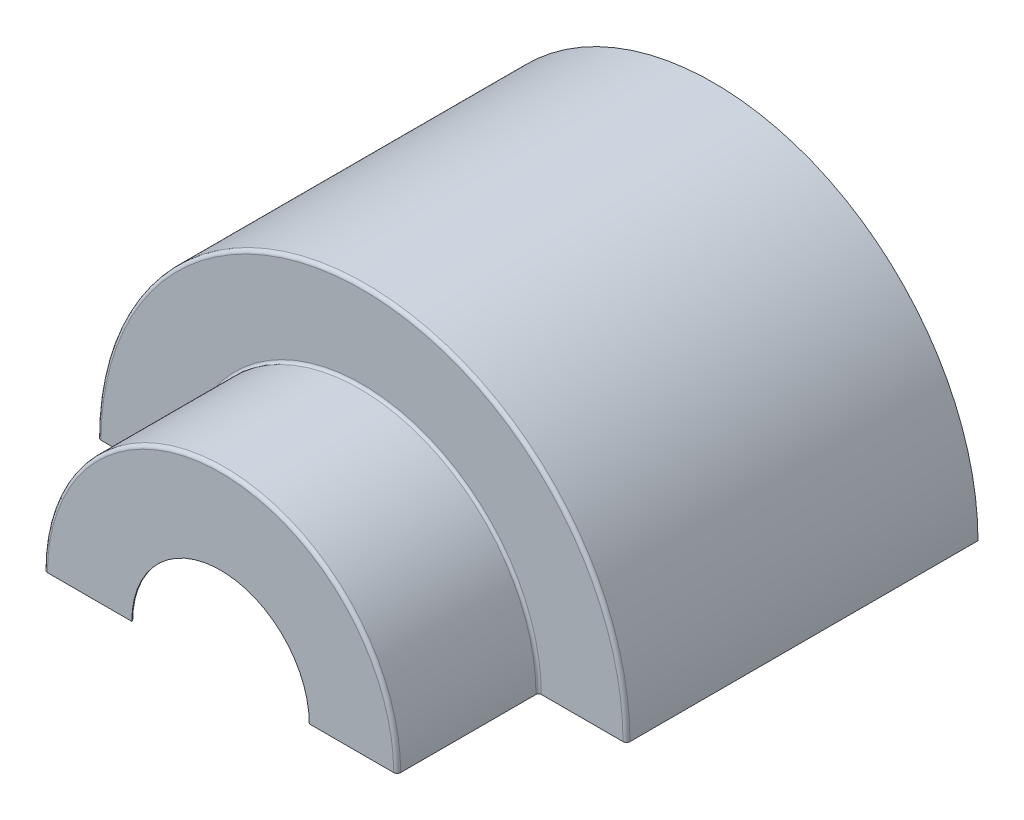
ISO-10303-21;
HEADER;
FILE_DESCRIPTION(('STEP AP214'),'2;1');
FILE_NAME('part.step','',(''),(''),'','','');
FILE_SCHEMA(('AUTOMOTIVE_DESIGN { 1 0 10303 214 1 1 1 1 }'));
ENDSEC;
DATA;
#1=APPLICATION_CONTEXT('core data for automotive mechanical design processes');
#2=APPLICATION_PROTOCOL_DEFINITION('international standard','automotive_design',2000,#1);
#3=PRODUCT_CONTEXT('',#1,'mechanical');
#4=PRODUCT('Part','Part','',(#3));
#5=PRODUCT_RELATED_PRODUCT_CATEGORY('part','',(#4));
#6=PRODUCT_DEFINITION_FORMATION('','',#4);
#7=PRODUCT_DEFINITION_CONTEXT('part definition',#1,'design');
#8=PRODUCT_DEFINITION('design','',#6,#7);
#9=PRODUCT_DEFINITION_SHAPE('','',#8);
#10=(LENGTH_UNIT() NAMED_UNIT(*) SI_UNIT(.MILLI.,.METRE.));
#11=(NAMED_UNIT(*) PLANE_ANGLE_UNIT() SI_UNIT($,.RADIAN.));
#12=(NAMED_UNIT(*) SI_UNIT($,.STERADIAN.) SOLID_ANGLE_UNIT());
#13=UNCERTAINTY_MEASURE_WITH_UNIT(LENGTH_MEASURE(1.E-05),#10,'distance_accuracy_value','');
#14=(GEOMETRIC_REPRESENTATION_CONTEXT(3) GLOBAL_UNCERTAINTY_ASSIGNED_CONTEXT((#13)) GLOBAL_UNIT_ASSIGNED_CONTEXT((#10,
#11,#12)) REPRESENTATION_CONTEXT('',''));
#15=CARTESIAN_POINT('',(0.,0.,0.));
#16=DIRECTION('',(0.,0.,1.));
#17=DIRECTION('',(1.,0.,0.));
#18=AXIS2_PLACEMENT_3D('',#15,#16,#17);
#19=CARTESIAN_POINT('',(100.5,0.,-80.));
#20=DIRECTION('',(0.,-1.,0.));
#21=DIRECTION('',(1.,0.,0.));
#22=AXIS2_PLACEMENT_3D('',#19,#20,#21);
#23=PLANE('',#22);
#24=DIRECTION('',(0.,0.,1.));
#25=VECTOR('',#24,1.);
#26=CARTESIAN_POINT('',(148.5,0.,-80.5));
#27=LINE('',#26,#25);
#28=CARTESIAN_POINT('',(148.5,0.,-80.5));
#29=VERTEX_POINT('',#28);
#30=CARTESIAN_POINT('',(148.5,0.,-80.));
#31=VERTEX_POINT('',#30);
#32=EDGE_CURVE('E329',#29,#31,#27,.T.);
#33=ORIENTED_EDGE('',*,*,#32,.T.);
#34=DIRECTION('',(1.,0.,0.));
#35=VECTOR('',#34,1.);
#36=CARTESIAN_POINT('',(100.5,0.,-80.));
#37=LINE('',#36,#35);
#38=CARTESIAN_POINT('',(102.,0.,-80.));
#39=VERTEX_POINT('',#38);
#40=EDGE_CURVE('E340',#39,#31,#37,.T.);
#41=ORIENTED_EDGE('',*,*,#40,.F.);
#42=DIRECTION('',(0.,0.,1.));
#43=VECTOR('',#42,1.);
#44=CARTESIAN_POINT('',(102.,0.,-80.));
#45=LINE('',#44,#43);
#46=CARTESIAN_POINT('',(102.,0.,-80.5));
#47=VERTEX_POINT('',#46);
#48=EDGE_CURVE('E355',#47,#39,#45,.T.);
#49=ORIENTED_EDGE('',*,*,#48,.F.);
#50=DIRECTION('',(1.,0.,0.));
#51=VECTOR('',#50,1.);
#52=CARTESIAN_POINT('',(100.5,0.,-80.5));
#53=LINE('',#52,#51);
#54=EDGE_CURVE('E360',#47,#29,#53,.T.);
#55=ORIENTED_EDGE('',*,*,#54,.T.);
#56=EDGE_LOOP('',(#33,#41,#49,#55));
#57=FACE_BOUND('',#56,.T.);
#58=ADVANCED_FACE('F159',(#57),#23,.T.);
#59=CARTESIAN_POINT('',(100.5,0.,-80.));
#60=DIRECTION('',(0.,0.,1.));
#61=DIRECTION('',(1.,0.,0.));
#62=AXIS2_PLACEMENT_3D('',#59,#60,#61);
#63=PLANE('',#62);
#64=ORIENTED_EDGE('',*,*,#40,.T.);
#65=CARTESIAN_POINT('',(0.,0.,-80.));
#66=DIRECTION('',(0.,0.,1.));
#67=DIRECTION('',(1.,0.,0.));
#68=AXIS2_PLACEMENT_3D('',#65,#66,#67);
#69=CIRCLE('',#68,148.5);
#70=CARTESIAN_POINT('',(-148.5,0.,-80.));
#71=VERTEX_POINT('',#70);
#72=EDGE_CURVE('E295',#31,#71,#69,.T.);
#73=ORIENTED_EDGE('',*,*,#72,.T.);
#74=DIRECTION('',(-1.,0.,0.));
#75=VECTOR('',#74,1.);
#76=CARTESIAN_POINT('',(-100.5,0.,-80.));
#77=LINE('',#76,#75);
#78=CARTESIAN_POINT('',(-102.,0.,-80.));
#79=VERTEX_POINT('',#78);
#80=EDGE_CURVE('E349',#79,#71,#77,.T.);
#81=ORIENTED_EDGE('',*,*,#80,.F.);
#82=CARTESIAN_POINT('',(0.,0.,-80.));
#83=DIRECTION('',(0.,0.,1.));
#84=DIRECTION('',(1.,0.,0.));
#85=AXIS2_PLACEMENT_3D('',#82,#83,#84);
#86=CIRCLE('',#85,102.);
#87=EDGE_CURVE('E345',#39,#79,#86,.T.);
#88=ORIENTED_EDGE('',*,*,#87,.F.);
#89=EDGE_LOOP('',(#64,#73,#81,#88));
#90=FACE_BOUND('',#89,.T.);
#91=ADVANCED_FACE('F501',(#90),#63,.T.);
#92=CARTESIAN_POINT('',(100.5,0.,-80.5));
#93=DIRECTION('',(0.,0.,1.));
#94=DIRECTION('',(1.,0.,0.));
#95=AXIS2_PLACEMENT_3D('',#92,#93,#94);
#96=PLANE('',#95);
#97=CARTESIAN_POINT('',(0.,0.,-80.5));
#98=DIRECTION('',(0.,0.,1.));
#99=DIRECTION('',(1.,0.,0.));
#100=AXIS2_PLACEMENT_3D('',#97,#98,#99);
#101=CIRCLE('',#100,148.5);
#102=CARTESIAN_POINT('',(-148.5,0.,-80.5));
#103=VERTEX_POINT('',#102);
#104=EDGE_CURVE('E319',#29,#103,#101,.T.);
#105=ORIENTED_EDGE('',*,*,#104,.F.);
#106=ORIENTED_EDGE('',*,*,#54,.F.);
#107=CARTESIAN_POINT('',(0.,0.,-80.5));
#108=DIRECTION('',(0.,0.,1.));
#109=DIRECTION('',(1.,0.,0.));
#110=AXIS2_PLACEMENT_3D('',#107,#108,#109);
#111=CIRCLE('',#110,102.);
#112=CARTESIAN_POINT('',(-102.,0.,-80.5));
#113=VERTEX_POINT('',#112);
#114=EDGE_CURVE('E356',#47,#113,#111,.T.);
#115=ORIENTED_EDGE('',*,*,#114,.T.);
#116=DIRECTION('',(1.,0.,0.));
#117=VECTOR('',#116,1.);
#118=CARTESIAN_POINT('',(100.5,0.,-80.5));
#119=LINE('',#118,#117);
#120=EDGE_CURVE('E341',#113,#103,#119,.F.);
#121=ORIENTED_EDGE('',*,*,#120,.T.);
#122=EDGE_LOOP('',(#105,#106,#115,#121));
#123=FACE_BOUND('',#122,.T.);
#124=ADVANCED_FACE('F488',(#123),#96,.F.);
#125=CARTESIAN_POINT('',(100.5,0.,-80.));
#126=DIRECTION('',(0.,1.,0.));
#127=DIRECTION('',(-1.,0.,0.));
#128=AXIS2_PLACEMENT_3D('',#125,#126,#127);
#129=PLANE('',#128);
#130=DIRECTION('',(1.,0.,0.));
#131=VECTOR('',#130,1.);
#132=CARTESIAN_POINT('',(100.5,0.,-78.5));
#133=LINE('',#132,#131);
#134=CARTESIAN_POINT('',(100.,0.,-78.5));
#135=VERTEX_POINT('',#134);
#136=CARTESIAN_POINT('',(100.5,0.,-78.5));
#137=VERTEX_POINT('',#136);
#138=EDGE_CURVE('E372',#135,#137,#133,.T.);
#139=ORIENTED_EDGE('',*,*,#138,.T.);
#140=DIRECTION('',(0.,0.,1.));
#141=VECTOR('',#140,1.);
#142=CARTESIAN_POINT('',(100.5,0.,-80.));
#143=LINE('',#142,#141);
#144=CARTESIAN_POINT('',(100.5,0.,-1.49999999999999));
#145=VERTEX_POINT('',#144);
#146=EDGE_CURVE('E12',#137,#145,#143,.T.);
#147=ORIENTED_EDGE('',*,*,#146,.T.);
#148=DIRECTION('',(-1.,0.,0.));
#149=VECTOR('',#148,1.);
#150=CARTESIAN_POINT('',(100.,0.,-1.5));
#151=LINE('',#150,#149);
#152=CARTESIAN_POINT('',(100.,0.,-1.5));
#153=VERTEX_POINT('',#152);
#154=EDGE_CURVE('E427',#145,#153,#151,.T.);
#155=ORIENTED_EDGE('',*,*,#154,.T.);
#156=DIRECTION('',(0.,0.,1.));
#157=VECTOR('',#156,1.);
#158=CARTESIAN_POINT('',(100.,0.,-80.));
#159=LINE('',#158,#157);
#160=EDGE_CURVE('E168',#135,#153,#159,.T.);
#161=ORIENTED_EDGE('',*,*,#160,.F.);
#162=EDGE_LOOP('',(#139,#147,#155,#161));
#163=FACE_BOUND('',#162,.T.);
#164=ADVANCED_FACE('F475',(#163),#129,.F.);
#165=CARTESIAN_POINT('',(0.,0.,-80.));
#166=DIRECTION('',(0.,0.,1.));
#167=DIRECTION('',(1.,0.,0.));
#168=AXIS2_PLACEMENT_3D('',#165,#166,#167);
#169=CYLINDRICAL_SURFACE('',#168,100.5);
#170=ORIENTED_EDGE('',*,*,#146,.F.);
#171=CARTESIAN_POINT('',(0.,0.,-78.5));
#172=DIRECTION('',(0.,0.,1.));
#173=DIRECTION('',(1.,0.,0.));
#174=AXIS2_PLACEMENT_3D('',#171,#172,#173);
#175=CIRCLE('',#174,100.5);
#176=CARTESIAN_POINT('',(-100.5,0.,-78.5));
#177=VERTEX_POINT('',#176);
#178=EDGE_CURVE('E346',#137,#177,#175,.T.);
#179=ORIENTED_EDGE('',*,*,#178,.T.);
#180=DIRECTION('',(0.,0.,1.));
#181=VECTOR('',#180,1.);
#182=CARTESIAN_POINT('',(-100.5,0.,-80.));
#183=LINE('',#182,#181);
#184=CARTESIAN_POINT('',(-100.5,0.,-1.49999999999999));
#185=VERTEX_POINT('',#184);
#186=EDGE_CURVE('E163',#177,#185,#183,.T.);
#187=ORIENTED_EDGE('',*,*,#186,.T.);
#188=CARTESIAN_POINT('',(0.,0.,-1.5));
#189=DIRECTION('',(0.,0.,1.));
#190=DIRECTION('',(1.,0.,0.));
#191=AXIS2_PLACEMENT_3D('',#188,#189,#190);
#192=CIRCLE('',#191,100.5);
#193=EDGE_CURVE('E414',#145,#185,#192,.T.);
#194=ORIENTED_EDGE('',*,*,#193,.F.);
#195=EDGE_LOOP('',(#170,#179,#187,#194));
#196=FACE_BOUND('',#195,.T.);
#197=ADVANCED_FACE('F161',(#196),#169,.T.);
#198=CARTESIAN_POINT('',(0.,0.,-80.));
#199=DIRECTION('',(0.,0.,1.));
#200=DIRECTION('',(1.,0.,0.));
#201=AXIS2_PLACEMENT_3D('',#198,#199,#200);
#202=CYLINDRICAL_SURFACE('',#201,100.);
#203=CARTESIAN_POINT('',(0.,0.,-78.5));
#204=DIRECTION('',(0.,0.,1.));
#205=DIRECTION('',(1.,0.,0.));
#206=AXIS2_PLACEMENT_3D('',#203,#204,#205);
#207=CIRCLE('',#206,100.);
#208=CARTESIAN_POINT('',(-100.,0.,-78.5));
#209=VERTEX_POINT('',#208);
#210=EDGE_CURVE('E363',#135,#209,#207,.T.);
#211=ORIENTED_EDGE('',*,*,#210,.F.);
#212=ORIENTED_EDGE('',*,*,#160,.T.);
#213=CARTESIAN_POINT('',(0.,0.,-1.5));
#214=DIRECTION('',(0.,0.,1.));
#215=DIRECTION('',(1.,0.,0.));
#216=AXIS2_PLACEMENT_3D('',#213,#214,#215);
#217=CIRCLE('',#216,100.);
#218=CARTESIAN_POINT('',(-100.,0.,-1.49999999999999));
#219=VERTEX_POINT('',#218);
#220=EDGE_CURVE('E390',#153,#219,#217,.T.);
#221=ORIENTED_EDGE('',*,*,#220,.T.);
#222=DIRECTION('',(0.,0.,1.));
#223=VECTOR('',#222,1.);
#224=CARTESIAN_POINT('',(-100.,0.,-80.));
#225=LINE('',#224,#223);
#226=EDGE_CURVE('E436',#209,#219,#225,.T.);
#227=ORIENTED_EDGE('',*,*,#226,.F.);
#228=EDGE_LOOP('',(#211,#212,#221,#227));
#229=FACE_BOUND('',#228,.T.);
#230=ADVANCED_FACE('F444',(#229),#202,.F.);
#231=CARTESIAN_POINT('',(-100.,0.,-80.));
#232=DIRECTION('',(0.,1.,0.));
#233=DIRECTION('',(-1.,0.,0.));
#234=AXIS2_PLACEMENT_3D('',#231,#232,#233);
#235=PLANE('',#234);
#236=ORIENTED_EDGE('',*,*,#186,.F.);
#237=DIRECTION('',(-1.,0.,0.));
#238=VECTOR('',#237,1.);
#239=CARTESIAN_POINT('',(-100.5,0.,-78.5));
#240=LINE('',#239,#238);
#241=EDGE_CURVE('E375',#209,#177,#240,.T.);
#242=ORIENTED_EDGE('',*,*,#241,.F.);
#243=ORIENTED_EDGE('',*,*,#226,.T.);
#244=DIRECTION('',(1.,0.,0.));
#245=VECTOR('',#244,1.);
#246=CARTESIAN_POINT('',(-100.,0.,-1.5));
#247=LINE('',#246,#245);
#248=EDGE_CURVE('E430',#185,#219,#247,.T.);
#249=ORIENTED_EDGE('',*,*,#248,.F.);
#250=EDGE_LOOP('',(#236,#242,#243,#249));
#251=FACE_BOUND('',#250,.T.);
#252=ADVANCED_FACE('F440',(#251),#235,.F.);
#253=CARTESIAN_POINT('',(-98.5,0.,-1.5));
#254=DIRECTION('',(0.,1.,0.));
#255=DIRECTION('',(-1.,0.,0.));
#256=AXIS2_PLACEMENT_3D('',#253,#254,#255);
#257=PLANE('',#256);
#258=DIRECTION('',(0.,0.,-1.));
#259=VECTOR('',#258,1.);
#260=CARTESIAN_POINT('',(-98.5,0.,0.));
#261=LINE('',#260,#259);
#262=CARTESIAN_POINT('',(-98.5,0.,0.5));
#263=VERTEX_POINT('',#262);
#264=CARTESIAN_POINT('',(-98.5,0.,0.));
#265=VERTEX_POINT('',#264);
#266=EDGE_CURVE('E433',#263,#265,#261,.T.);
#267=ORIENTED_EDGE('',*,*,#266,.F.);
#268=CARTESIAN_POINT('',(-98.5,0.,-1.5));
#269=DIRECTION('',(0.,1.,0.));
#270=DIRECTION('',(-1.,0.,0.));
#271=AXIS2_PLACEMENT_3D('',#268,#269,#270);
#272=CIRCLE('',#271,2.);
#273=EDGE_CURVE('E408',#185,#263,#272,.T.);
#274=ORIENTED_EDGE('',*,*,#273,.F.);
#275=ORIENTED_EDGE('',*,*,#248,.T.);
#276=CARTESIAN_POINT('',(-98.5,0.,-1.5));
#277=DIRECTION('',(0.,-1.,0.));
#278=DIRECTION('',(1.,0.,0.));
#279=AXIS2_PLACEMENT_3D('',#276,#277,#278);
#280=CIRCLE('',#279,1.5);
#281=EDGE_CURVE('E386',#219,#265,#280,.F.);
#282=ORIENTED_EDGE('',*,*,#281,.T.);
#283=EDGE_LOOP('',(#267,#274,#275,#282));
#284=FACE_BOUND('',#283,.T.);
#285=ADVANCED_FACE('F451',(#284),#257,.F.);
#286=CARTESIAN_POINT('',(98.5,0.,-1.5));
#287=DIRECTION('',(0.,-1.,0.));
#288=DIRECTION('',(1.,0.,0.));
#289=AXIS2_PLACEMENT_3D('',#286,#287,#288);
#290=PLANE('',#289);
#291=ORIENTED_EDGE('',*,*,#154,.F.);
#292=CARTESIAN_POINT('',(98.5,0.,-1.5));
#293=DIRECTION('',(0.,-1.,0.));
#294=DIRECTION('',(1.,0.,0.));
#295=AXIS2_PLACEMENT_3D('',#292,#293,#294);
#296=CIRCLE('',#295,2.);
#297=CARTESIAN_POINT('',(98.5,0.,0.499999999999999));
#298=VERTEX_POINT('',#297);
#299=EDGE_CURVE('E380',#145,#298,#296,.T.);
#300=ORIENTED_EDGE('',*,*,#299,.T.);
#301=DIRECTION('',(0.,0.,-1.));
#302=VECTOR('',#301,1.);
#303=CARTESIAN_POINT('',(98.5,0.,0.));
#304=LINE('',#303,#302);
#305=CARTESIAN_POINT('',(98.5,0.,0.));
#306=VERTEX_POINT('',#305);
#307=EDGE_CURVE('E425',#298,#306,#304,.T.);
#308=ORIENTED_EDGE('',*,*,#307,.T.);
#309=CARTESIAN_POINT('',(98.5,0.,-1.5));
#310=DIRECTION('',(0.,1.,0.));
#311=DIRECTION('',(-1.,0.,0.));
#312=AXIS2_PLACEMENT_3D('',#309,#310,#311);
#313=CIRCLE('',#312,1.5);
#314=EDGE_CURVE('E381',#153,#306,#313,.F.);
#315=ORIENTED_EDGE('',*,*,#314,.F.);
#316=EDGE_LOOP('',(#291,#300,#308,#315));
#317=FACE_BOUND('',#316,.T.);
#318=ADVANCED_FACE('F473',(#317),#290,.T.);
#319=CARTESIAN_POINT('',(100.,0.,0.));
#320=DIRECTION('',(0.,-1.,0.));
#321=DIRECTION('',(-1.,0.,0.));
#322=AXIS2_PLACEMENT_3D('',#319,#320,#321);
#323=PLANE('',#322);
#324=ORIENTED_EDGE('',*,*,#307,.F.);
#325=DIRECTION('',(-1.,0.,0.));
#326=VECTOR('',#325,1.);
#327=CARTESIAN_POINT('',(100.,0.,0.5));
#328=LINE('',#327,#326);
#329=CARTESIAN_POINT('',(50.5,0.,0.5));
#330=VERTEX_POINT('',#329);
#331=EDGE_CURVE('E411',#298,#330,#328,.T.);
#332=ORIENTED_EDGE('',*,*,#331,.T.);
#333=DIRECTION('',(0.,0.,-1.));
#334=VECTOR('',#333,1.);
#335=CARTESIAN_POINT('',(50.5,0.,0.));
#336=LINE('',#335,#334);
#337=CARTESIAN_POINT('',(50.5,0.,0.));
#338=VERTEX_POINT('',#337);
#339=EDGE_CURVE('E423',#330,#338,#336,.T.);
#340=ORIENTED_EDGE('',*,*,#339,.T.);
#341=DIRECTION('',(-1.,0.,0.));
#342=VECTOR('',#341,1.);
#343=CARTESIAN_POINT('',(100.,0.,0.));
#344=LINE('',#343,#342);
#345=EDGE_CURVE('E384',#306,#338,#344,.T.);
#346=ORIENTED_EDGE('',*,*,#345,.F.);
#347=EDGE_LOOP('',(#324,#332,#340,#346));
#348=FACE_BOUND('',#347,.T.);
#349=ADVANCED_FACE('F552',(#348),#323,.T.);
#350=CARTESIAN_POINT('',(0.,0.,0.));
#351=DIRECTION('',(0.,0.,-1.));
#352=DIRECTION('',(-1.,0.,0.));
#353=AXIS2_PLACEMENT_3D('',#350,#351,#352);
#354=CYLINDRICAL_SURFACE('',#353,50.5);
#355=ORIENTED_EDGE('',*,*,#339,.F.);
#356=CARTESIAN_POINT('',(0.,0.,0.5));
#357=DIRECTION('',(0.,0.,1.));
#358=DIRECTION('',(1.,0.,0.));
#359=AXIS2_PLACEMENT_3D('',#356,#357,#358);
#360=CIRCLE('',#359,50.5);
#361=CARTESIAN_POINT('',(-50.5,0.,0.5));
#362=VERTEX_POINT('',#361);
#363=EDGE_CURVE('E385',#330,#362,#360,.T.);
#364=ORIENTED_EDGE('',*,*,#363,.T.);
#365=DIRECTION('',(0.,0.,-1.));
#366=VECTOR('',#365,1.);
#367=CARTESIAN_POINT('',(-50.5,0.,0.));
#368=LINE('',#367,#366);
#369=CARTESIAN_POINT('',(-50.5,0.,0.));
#370=VERTEX_POINT('',#369);
#371=EDGE_CURVE('E403',#362,#370,#368,.T.);
#372=ORIENTED_EDGE('',*,*,#371,.T.);
#373=CARTESIAN_POINT('',(0.,0.,0.));
#374=DIRECTION('',(0.,0.,1.));
#375=DIRECTION('',(1.,0.,0.));
#376=AXIS2_PLACEMENT_3D('',#373,#374,#375);
#377=CIRCLE('',#376,50.5);
#378=EDGE_CURVE('E400',#338,#370,#377,.T.);
#379=ORIENTED_EDGE('',*,*,#378,.F.);
#380=EDGE_LOOP('',(#355,#364,#372,#379));
#381=FACE_BOUND('',#380,.T.);
#382=ADVANCED_FACE('F549',(#381),#354,.F.);
#383=CARTESIAN_POINT('',(-100.,0.,0.));
#384=DIRECTION('',(0.,1.,0.));
#385=DIRECTION('',(1.,0.,0.));
#386=AXIS2_PLACEMENT_3D('',#383,#384,#385);
#387=PLANE('',#386);
#388=DIRECTION('',(-1.,0.,0.));
#389=VECTOR('',#388,1.);
#390=CARTESIAN_POINT('',(100.,0.,0.5));
#391=LINE('',#390,#389);
#392=EDGE_CURVE('E407',#263,#362,#391,.F.);
#393=ORIENTED_EDGE('',*,*,#392,.F.);
#394=ORIENTED_EDGE('',*,*,#266,.T.);
#395=DIRECTION('',(1.,0.,0.));
#396=VECTOR('',#395,1.);
#397=CARTESIAN_POINT('',(-100.,0.,0.));
#398=LINE('',#397,#396);
#399=EDGE_CURVE('E393',#265,#370,#398,.T.);
#400=ORIENTED_EDGE('',*,*,#399,.T.);
#401=ORIENTED_EDGE('',*,*,#371,.F.);
#402=EDGE_LOOP('',(#393,#394,#400,#401));
#403=FACE_BOUND('',#402,.T.);
#404=ADVANCED_FACE('F461',(#403),#387,.F.);
#405=CARTESIAN_POINT('',(100.,0.,0.));
#406=DIRECTION('',(0.,0.,-1.));
#407=DIRECTION('',(-1.,0.,0.));
#408=AXIS2_PLACEMENT_3D('',#405,#406,#407);
#409=PLANE('',#408);
#410=ORIENTED_EDGE('',*,*,#378,.T.);
#411=ORIENTED_EDGE('',*,*,#399,.F.);
#412=CARTESIAN_POINT('',(0.,0.,0.));
#413=DIRECTION('',(0.,0.,1.));
#414=DIRECTION('',(1.,0.,0.));
#415=AXIS2_PLACEMENT_3D('',#412,#413,#414);
#416=CIRCLE('',#415,98.5);
#417=EDGE_CURVE('E389',#306,#265,#416,.T.);
#418=ORIENTED_EDGE('',*,*,#417,.F.);
#419=ORIENTED_EDGE('',*,*,#345,.T.);
#420=EDGE_LOOP('',(#410,#411,#418,#419));
#421=FACE_BOUND('',#420,.T.);
#422=ADVANCED_FACE('F457',(#421),#409,.T.);
#423=CARTESIAN_POINT('',(0.,0.,-1.5));
#424=DIRECTION('',(0.,0.,1.));
#425=DIRECTION('',(1.,0.,0.));
#426=AXIS2_PLACEMENT_3D('',#423,#424,#425);
#427=TOROIDAL_SURFACE('',#426,98.5,1.5);
#428=ORIENTED_EDGE('',*,*,#417,.T.);
#429=ORIENTED_EDGE('',*,*,#281,.F.);
#430=ORIENTED_EDGE('',*,*,#220,.F.);
#431=ORIENTED_EDGE('',*,*,#314,.T.);
#432=EDGE_LOOP('',(#428,#429,#430,#431));
#433=FACE_BOUND('',#432,.T.);
#434=ADVANCED_FACE('F452',(#433),#427,.F.);
#435=CARTESIAN_POINT('',(100.,0.,0.5));
#436=DIRECTION('',(0.,0.,-1.));
#437=DIRECTION('',(-1.,0.,0.));
#438=AXIS2_PLACEMENT_3D('',#435,#436,#437);
#439=PLANE('',#438);
#440=ORIENTED_EDGE('',*,*,#363,.F.);
#441=ORIENTED_EDGE('',*,*,#331,.F.);
#442=CARTESIAN_POINT('',(0.,0.,0.499999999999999));
#443=DIRECTION('',(0.,0.,1.));
#444=DIRECTION('',(1.,0.,0.));
#445=AXIS2_PLACEMENT_3D('',#442,#443,#444);
#446=CIRCLE('',#445,98.5);
#447=EDGE_CURVE('E404',#298,#263,#446,.T.);
#448=ORIENTED_EDGE('',*,*,#447,.T.);
#449=ORIENTED_EDGE('',*,*,#392,.T.);
#450=EDGE_LOOP('',(#440,#441,#448,#449));
#451=FACE_BOUND('',#450,.T.);
#452=ADVANCED_FACE('F466',(#451),#439,.F.);
#453=CARTESIAN_POINT('',(0.,0.,-1.5));
#454=DIRECTION('',(0.,0.,1.));
#455=DIRECTION('',(1.,0.,0.));
#456=AXIS2_PLACEMENT_3D('',#453,#454,#455);
#457=TOROIDAL_SURFACE('',#456,98.5,2.);
#458=ORIENTED_EDGE('',*,*,#447,.F.);
#459=ORIENTED_EDGE('',*,*,#299,.F.);
#460=ORIENTED_EDGE('',*,*,#193,.T.);
#461=ORIENTED_EDGE('',*,*,#273,.T.);
#462=EDGE_LOOP('',(#458,#459,#460,#461));
#463=FACE_BOUND('',#462,.T.);
#464=ADVANCED_FACE('F469',(#463),#457,.T.);
#465=CARTESIAN_POINT('',(-102.,0.,-78.5));
#466=DIRECTION('',(0.,1.,0.));
#467=DIRECTION('',(-1.,0.,0.));
#468=AXIS2_PLACEMENT_3D('',#465,#466,#467);
#469=PLANE('',#468);
#470=DIRECTION('',(0.,0.,1.));
#471=VECTOR('',#470,1.);
#472=CARTESIAN_POINT('',(-102.,0.,-80.));
#473=LINE('',#472,#471);
#474=EDGE_CURVE('E378',#113,#79,#473,.T.);
#475=ORIENTED_EDGE('',*,*,#474,.F.);
#476=CARTESIAN_POINT('',(-102.,0.,-78.5));
#477=DIRECTION('',(0.,1.,0.));
#478=DIRECTION('',(-1.,0.,0.));
#479=AXIS2_PLACEMENT_3D('',#476,#477,#478);
#480=CIRCLE('',#479,2.);
#481=EDGE_CURVE('E359',#209,#113,#480,.T.);
#482=ORIENTED_EDGE('',*,*,#481,.F.);
#483=ORIENTED_EDGE('',*,*,#241,.T.);
#484=CARTESIAN_POINT('',(-102.,0.,-78.5));
#485=DIRECTION('',(0.,-1.,0.));
#486=DIRECTION('',(1.,0.,0.));
#487=AXIS2_PLACEMENT_3D('',#484,#485,#486);
#488=CIRCLE('',#487,1.5);
#489=EDGE_CURVE('E342',#177,#79,#488,.F.);
#490=ORIENTED_EDGE('',*,*,#489,.T.);
#491=EDGE_LOOP('',(#475,#482,#483,#490));
#492=FACE_BOUND('',#491,.T.);
#493=ADVANCED_FACE('F495',(#492),#469,.F.);
#494=CARTESIAN_POINT('',(102.,0.,-78.5));
#495=DIRECTION('',(0.,-1.,0.));
#496=DIRECTION('',(1.,0.,0.));
#497=AXIS2_PLACEMENT_3D('',#494,#495,#496);
#498=PLANE('',#497);
#499=ORIENTED_EDGE('',*,*,#138,.F.);
#500=CARTESIAN_POINT('',(102.,0.,-78.5));
#501=DIRECTION('',(0.,-1.,0.));
#502=DIRECTION('',(1.,0.,0.));
#503=AXIS2_PLACEMENT_3D('',#500,#501,#502);
#504=CIRCLE('',#503,2.);
#505=EDGE_CURVE('E335',#135,#47,#504,.T.);
#506=ORIENTED_EDGE('',*,*,#505,.T.);
#507=ORIENTED_EDGE('',*,*,#48,.T.);
#508=CARTESIAN_POINT('',(102.,0.,-78.5));
#509=DIRECTION('',(0.,1.,0.));
#510=DIRECTION('',(-1.,0.,0.));
#511=AXIS2_PLACEMENT_3D('',#508,#509,#510);
#512=CIRCLE('',#511,1.5);
#513=EDGE_CURVE('E337',#137,#39,#512,.F.);
#514=ORIENTED_EDGE('',*,*,#513,.F.);
#515=EDGE_LOOP('',(#499,#506,#507,#514));
#516=FACE_BOUND('',#515,.T.);
#517=ADVANCED_FACE('F479',(#516),#498,.T.);
#518=CARTESIAN_POINT('',(-100.5,0.,-80.));
#519=DIRECTION('',(0.,1.,0.));
#520=DIRECTION('',(-1.,0.,0.));
#521=AXIS2_PLACEMENT_3D('',#518,#519,#520);
#522=PLANE('',#521);
#523=ORIENTED_EDGE('',*,*,#80,.T.);
#524=DIRECTION('',(0.,0.,1.));
#525=VECTOR('',#524,1.);
#526=CARTESIAN_POINT('',(-148.5,0.,-80.5));
#527=LINE('',#526,#525);
#528=EDGE_CURVE('E332',#103,#71,#527,.T.);
#529=ORIENTED_EDGE('',*,*,#528,.F.);
#530=ORIENTED_EDGE('',*,*,#120,.F.);
#531=ORIENTED_EDGE('',*,*,#474,.T.);
#532=EDGE_LOOP('',(#523,#529,#530,#531));
#533=FACE_BOUND('',#532,.T.);
#534=ADVANCED_FACE('F498',(#533),#522,.F.);
#535=CARTESIAN_POINT('',(0.,0.,-78.5));
#536=DIRECTION('',(0.,0.,1.));
#537=DIRECTION('',(1.,0.,0.));
#538=AXIS2_PLACEMENT_3D('',#535,#536,#537);
#539=TOROIDAL_SURFACE('',#538,102.,1.5);
#540=ORIENTED_EDGE('',*,*,#87,.T.);
#541=ORIENTED_EDGE('',*,*,#489,.F.);
#542=ORIENTED_EDGE('',*,*,#178,.F.);
#543=ORIENTED_EDGE('',*,*,#513,.T.);
#544=EDGE_LOOP('',(#540,#541,#542,#543));
#545=FACE_BOUND('',#544,.T.);
#546=ADVANCED_FACE('F493',(#545),#539,.F.);
#547=CARTESIAN_POINT('',(0.,0.,-78.5));
#548=DIRECTION('',(0.,0.,1.));
#549=DIRECTION('',(1.,0.,0.));
#550=AXIS2_PLACEMENT_3D('',#547,#548,#549);
#551=TOROIDAL_SURFACE('',#550,102.,2.);
#552=ORIENTED_EDGE('',*,*,#114,.F.);
#553=ORIENTED_EDGE('',*,*,#505,.F.);
#554=ORIENTED_EDGE('',*,*,#210,.T.);
#555=ORIENTED_EDGE('',*,*,#481,.T.);
#556=EDGE_LOOP('',(#552,#553,#554,#555));
#557=FACE_BOUND('',#556,.T.);
#558=ADVANCED_FACE('F482',(#557),#551,.T.);
#559=CARTESIAN_POINT('',(-148.5,0.,-82.));
#560=DIRECTION('',(0.,-1.,0.));
#561=DIRECTION('',(1.,0.,0.));
#562=AXIS2_PLACEMENT_3D('',#559,#560,#561);
#563=PLANE('',#562);
#564=DIRECTION('',(-1.,0.,0.));
#565=VECTOR('',#564,1.);
#566=CARTESIAN_POINT('',(-150.,0.,-82.));
#567=LINE('',#566,#565);
#568=CARTESIAN_POINT('',(-150.,0.,-82.));
#569=VERTEX_POINT('',#568);
#570=CARTESIAN_POINT('',(-150.5,0.,-82.));
#571=VERTEX_POINT('',#570);
#572=EDGE_CURVE('E334',#569,#571,#567,.T.);
#573=ORIENTED_EDGE('',*,*,#572,.F.);
#574=CARTESIAN_POINT('',(-148.5,0.,-82.));
#575=DIRECTION('',(0.,1.,0.));
#576=DIRECTION('',(-1.,0.,0.));
#577=AXIS2_PLACEMENT_3D('',#574,#575,#576);
#578=CIRCLE('',#577,1.5);
#579=EDGE_CURVE('E315',#103,#569,#578,.F.);
#580=ORIENTED_EDGE('',*,*,#579,.F.);
#581=ORIENTED_EDGE('',*,*,#528,.T.);
#582=CARTESIAN_POINT('',(-148.5,0.,-82.));
#583=DIRECTION('',(0.,1.,0.));
#584=DIRECTION('',(-1.,0.,0.));
#585=AXIS2_PLACEMENT_3D('',#582,#583,#584);
#586=CIRCLE('',#585,2.);
#587=EDGE_CURVE('E176',#71,#571,#586,.F.);
#588=ORIENTED_EDGE('',*,*,#587,.T.);
#589=EDGE_LOOP('',(#573,#580,#581,#588));
#590=FACE_BOUND('',#589,.T.);
#591=ADVANCED_FACE('F517',(#590),#563,.T.);
#592=CARTESIAN_POINT('',(148.5,0.,-82.));
#593=DIRECTION('',(0.,1.,0.));
#594=DIRECTION('',(-1.,0.,0.));
#595=AXIS2_PLACEMENT_3D('',#592,#593,#594);
#596=PLANE('',#595);
#597=ORIENTED_EDGE('',*,*,#32,.F.);
#598=CARTESIAN_POINT('',(148.5,0.,-82.));
#599=DIRECTION('',(0.,-1.,0.));
#600=DIRECTION('',(1.,0.,0.));
#601=AXIS2_PLACEMENT_3D('',#598,#599,#600);
#602=CIRCLE('',#601,1.5);
#603=CARTESIAN_POINT('',(150.,0.,-82.));
#604=VERTEX_POINT('',#603);
#605=EDGE_CURVE('E312',#29,#604,#602,.F.);
#606=ORIENTED_EDGE('',*,*,#605,.T.);
#607=DIRECTION('',(1.,0.,0.));
#608=VECTOR('',#607,1.);
#609=CARTESIAN_POINT('',(150.,0.,-82.));
#610=LINE('',#609,#608);
#611=CARTESIAN_POINT('',(150.5,0.,-82.));
#612=VERTEX_POINT('',#611);
#613=EDGE_CURVE('E286',#604,#612,#610,.T.);
#614=ORIENTED_EDGE('',*,*,#613,.T.);
#615=CARTESIAN_POINT('',(148.5,0.,-82.));
#616=DIRECTION('',(0.,-1.,0.));
#617=DIRECTION('',(1.,0.,0.));
#618=AXIS2_PLACEMENT_3D('',#615,#616,#617);
#619=CIRCLE('',#618,2.);
#620=EDGE_CURVE('E296',#31,#612,#619,.F.);
#621=ORIENTED_EDGE('',*,*,#620,.F.);
#622=EDGE_LOOP('',(#597,#606,#614,#621));
#623=FACE_BOUND('',#622,.T.);
#624=ADVANCED_FACE('F505',(#623),#596,.F.);
#625=CARTESIAN_POINT('',(150.,0.,-181.));
#626=DIRECTION('',(0.,-1.,0.));
#627=DIRECTION('',(0.,0.,-1.));
#628=AXIS2_PLACEMENT_3D('',#625,#626,#627);
#629=PLANE('',#628);
#630=ORIENTED_EDGE('',*,*,#613,.F.);
#631=DIRECTION('',(0.,0.,-1.));
#632=VECTOR('',#631,1.);
#633=CARTESIAN_POINT('',(150.,0.,-80.5));
#634=LINE('',#633,#632);
#635=CARTESIAN_POINT('',(150.,0.,-280.));
#636=VERTEX_POINT('',#635);
#637=EDGE_CURVE('E281',#604,#636,#634,.T.);
#638=ORIENTED_EDGE('',*,*,#637,.T.);
#639=DIRECTION('',(1.,0.,0.));
#640=VECTOR('',#639,1.);
#641=CARTESIAN_POINT('',(150.,0.,-280.));
#642=LINE('',#641,#640);
#643=CARTESIAN_POINT('',(150.5,0.,-280.));
#644=VERTEX_POINT('',#643);
#645=EDGE_CURVE('E275',#636,#644,#642,.T.);
#646=ORIENTED_EDGE('',*,*,#645,.T.);
#647=DIRECTION('',(0.,0.,1.));
#648=VECTOR('',#647,1.);
#649=CARTESIAN_POINT('',(150.5,0.,-80.5));
#650=LINE('',#649,#648);
#651=EDGE_CURVE('E278',#612,#644,#650,.F.);
#652=ORIENTED_EDGE('',*,*,#651,.F.);
#653=EDGE_LOOP('',(#630,#638,#646,#652));
#654=FACE_BOUND('',#653,.T.);
#655=ADVANCED_FACE('F277',(#654),#629,.T.);
#656=CARTESIAN_POINT('',(0.,0.,-280.));
#657=DIRECTION('',(0.,0.,-1.));
#658=DIRECTION('',(-1.,0.,0.));
#659=AXIS2_PLACEMENT_3D('',#656,#657,#658);
#660=PLANE('',#659);
#661=ORIENTED_EDGE('',*,*,#645,.F.);
#662=CARTESIAN_POINT('',(0.,0.,-280.));
#663=DIRECTION('',(0.,0.,1.));
#664=DIRECTION('',(1.,0.,0.));
#665=AXIS2_PLACEMENT_3D('',#662,#663,#664);
#666=CIRCLE('',#665,150.);
#667=CARTESIAN_POINT('',(-150.,0.,-280.));
#668=VERTEX_POINT('',#667);
#669=EDGE_CURVE('E308',#636,#668,#666,.T.);
#670=ORIENTED_EDGE('',*,*,#669,.T.);
#671=DIRECTION('',(-1.,0.,0.));
#672=VECTOR('',#671,1.);
#673=CARTESIAN_POINT('',(-150.,0.,-280.));
#674=LINE('',#673,#672);
#675=CARTESIAN_POINT('',(-150.5,0.,-280.));
#676=VERTEX_POINT('',#675);
#677=EDGE_CURVE('E287',#668,#676,#674,.T.);
#678=ORIENTED_EDGE('',*,*,#677,.T.);
#679=CARTESIAN_POINT('',(0.,0.,-280.));
#680=DIRECTION('',(0.,0.,1.));
#681=DIRECTION('',(1.,0.,0.));
#682=AXIS2_PLACEMENT_3D('',#679,#680,#681);
#683=CIRCLE('',#682,150.5);
#684=EDGE_CURVE('E293',#644,#676,#683,.T.);
#685=ORIENTED_EDGE('',*,*,#684,.F.);
#686=EDGE_LOOP('',(#661,#670,#678,#685));
#687=FACE_BOUND('',#686,.T.);
#688=ADVANCED_FACE('F298',(#687),#660,.T.);
#689=CARTESIAN_POINT('',(-150.,0.,-181.));
#690=DIRECTION('',(0.,1.,0.));
#691=DIRECTION('',(0.,0.,-1.));
#692=AXIS2_PLACEMENT_3D('',#689,#690,#691);
#693=PLANE('',#692);
#694=DIRECTION('',(0.,0.,-1.));
#695=VECTOR('',#694,1.);
#696=CARTESIAN_POINT('',(-150.,0.,-80.5));
#697=LINE('',#696,#695);
#698=EDGE_CURVE('E322',#569,#668,#697,.T.);
#699=ORIENTED_EDGE('',*,*,#698,.F.);
#700=ORIENTED_EDGE('',*,*,#572,.T.);
#701=DIRECTION('',(0.,0.,1.));
#702=VECTOR('',#701,1.);
#703=CARTESIAN_POINT('',(-150.5,0.,-80.5));
#704=LINE('',#703,#702);
#705=EDGE_CURVE('E300',#571,#676,#704,.F.);
#706=ORIENTED_EDGE('',*,*,#705,.T.);
#707=ORIENTED_EDGE('',*,*,#677,.F.);
#708=EDGE_LOOP('',(#699,#700,#706,#707));
#709=FACE_BOUND('',#708,.T.);
#710=ADVANCED_FACE('F515',(#709),#693,.F.);
#711=CARTESIAN_POINT('',(0.,0.,-80.5));
#712=DIRECTION('',(0.,0.,1.));
#713=DIRECTION('',(1.,0.,0.));
#714=AXIS2_PLACEMENT_3D('',#711,#712,#713);
#715=CYLINDRICAL_SURFACE('',#714,150.5);
#716=ORIENTED_EDGE('',*,*,#684,.T.);
#717=ORIENTED_EDGE('',*,*,#705,.F.);
#718=CARTESIAN_POINT('',(0.,0.,-82.));
#719=DIRECTION('',(0.,0.,1.));
#720=DIRECTION('',(1.,0.,0.));
#721=AXIS2_PLACEMENT_3D('',#718,#719,#720);
#722=CIRCLE('',#721,150.5);
#723=EDGE_CURVE('E294',#612,#571,#722,.T.);
#724=ORIENTED_EDGE('',*,*,#723,.F.);
#725=ORIENTED_EDGE('',*,*,#651,.T.);
#726=EDGE_LOOP('',(#716,#717,#724,#725));
#727=FACE_BOUND('',#726,.T.);
#728=ADVANCED_FACE('F291',(#727),#715,.T.);
#729=CARTESIAN_POINT('',(0.,0.,-82.));
#730=DIRECTION('',(0.,0.,1.));
#731=DIRECTION('',(1.,0.,0.));
#732=AXIS2_PLACEMENT_3D('',#729,#730,#731);
#733=TOROIDAL_SURFACE('',#732,148.5,2.);
#734=ORIENTED_EDGE('',*,*,#723,.T.);
#735=ORIENTED_EDGE('',*,*,#587,.F.);
#736=ORIENTED_EDGE('',*,*,#72,.F.);
#737=ORIENTED_EDGE('',*,*,#620,.T.);
#738=EDGE_LOOP('',(#734,#735,#736,#737));
#739=FACE_BOUND('',#738,.T.);
#740=ADVANCED_FACE('F503',(#739),#733,.T.);
#741=CARTESIAN_POINT('',(0.,0.,-80.5));
#742=DIRECTION('',(0.,0.,1.));
#743=DIRECTION('',(1.,0.,0.));
#744=AXIS2_PLACEMENT_3D('',#741,#742,#743);
#745=CYLINDRICAL_SURFACE('',#744,150.);
#746=ORIENTED_EDGE('',*,*,#669,.F.);
#747=ORIENTED_EDGE('',*,*,#637,.F.);
#748=CARTESIAN_POINT('',(0.,0.,-82.));
#749=DIRECTION('',(0.,0.,1.));
#750=DIRECTION('',(1.,0.,0.));
#751=AXIS2_PLACEMENT_3D('',#748,#749,#750);
#752=CIRCLE('',#751,150.);
#753=EDGE_CURVE('E318',#604,#569,#752,.T.);
#754=ORIENTED_EDGE('',*,*,#753,.T.);
#755=ORIENTED_EDGE('',*,*,#698,.T.);
#756=EDGE_LOOP('',(#746,#747,#754,#755));
#757=FACE_BOUND('',#756,.T.);
#758=ADVANCED_FACE('F513',(#757),#745,.F.);
#759=CARTESIAN_POINT('',(0.,0.,-82.));
#760=DIRECTION('',(0.,0.,1.));
#761=DIRECTION('',(1.,0.,0.));
#762=AXIS2_PLACEMENT_3D('',#759,#760,#761);
#763=TOROIDAL_SURFACE('',#762,148.5,1.5);
#764=ORIENTED_EDGE('',*,*,#753,.F.);
#765=ORIENTED_EDGE('',*,*,#605,.F.);
#766=ORIENTED_EDGE('',*,*,#104,.T.);
#767=ORIENTED_EDGE('',*,*,#579,.T.);
#768=EDGE_LOOP('',(#764,#765,#766,#767));
#769=FACE_BOUND('',#768,.T.);
#770=ADVANCED_FACE('F509',(#769),#763,.F.);
#771=CLOSED_SHELL('',(#58,#91,#124,#164,#197,#230,#252,#285,#318,#349,#382,#404,#422,#434,#452,
#464,#493,#517,#534,#546,#558,#591,#624,#655,#688,#710,#728,#740,#758,#770));
#772=MANIFOLD_SOLID_BREP('B2',#771);
#773=ADVANCED_BREP_SHAPE_REPRESENTATION('',(#18,#772),#14);
#774=SHAPE_DEFINITION_REPRESENTATION(#9,#773);
ENDSEC;
END-ISO-10303-21;
